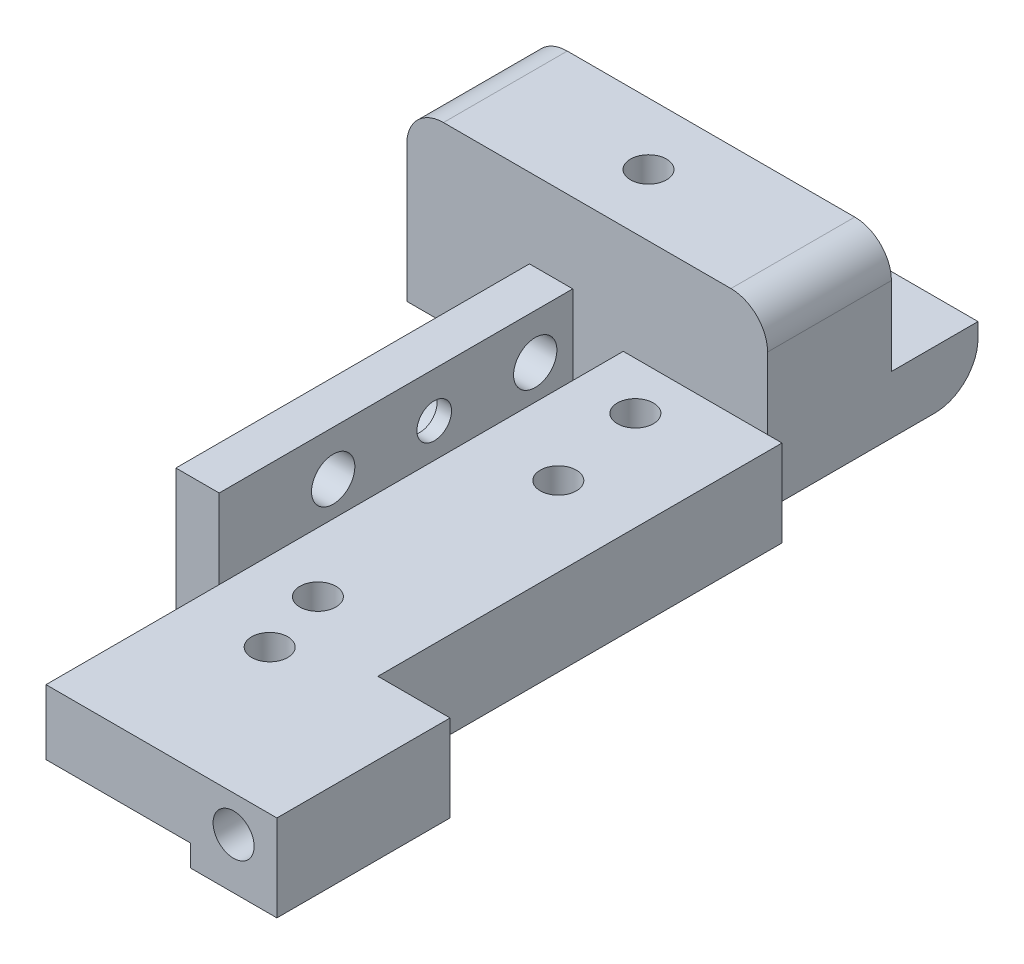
from build123d import *

# Parameters (mm, degrees)
SKETCH1_W                       = 11
SKETCH1_H                       = 40
BOSS_EXTRUDE1_DEPTH             = 4.5
SKETCH2_W                       = 1
SKETCH2_H                       = 40
BOSS_EXTRUDE2_DEPTH             = 2
M3X0_5_TAPPED_HOLE1_D           = 2.5
M3X0_5_TAPPED_HOLE1_DEPTH       = 8.5
M3X0_5_TAPPED_HOLE1_TIP         = 0.751075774
SKETCH8_W                       = 25
SKETCH8_H                       = 12
BOSS_EXTRUDE4_DEPTH             = 8.58
M3X0_5_TAPPED_HOLE2_D           = 2.5
M3X0_5_TAPPED_HOLE2_DEPTH       = 8.5
M3X0_5_TAPPED_HOLE2_TIP         = 0.751075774
SKETCH11_W                      = 24.5
SKETCH11_H                      = 10
BOSS_EXTRUDE5_DEPTH             = 3
SKETCH12_W                      = 25
SKETCH12_H                      = 4
BOSS_EXTRUDE6_DEPTH             = 6
FILLET1_R                       = 3
M3X0_5_TAPPED_HOLE4_D           = 2.5
M3X0_5_TAPPED_HOLE4_DEPTH       = 7.5
M3X0_5_TAPPED_HOLE4_TIP         = 0.751075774
SKETCH19_W                      = 5
SKETCH19_H                      = 12
BOSS_EXTRUDE7_DEPTH             = 6.5
F_4_40_TAPPED_HOLE1_D           = 2.2606
F_4_40_TAPPED_HOLE1_DEPTH       = 8.87
F_4_40_TAPPED_HOLE1_CBORE_D     = 2.8448
F_4_40_TAPPED_HOLE1_CBORE_DEPTH = 5.69
F_4_40_TAPPED_HOLE1_TIP         = 0.679152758
SKETCH23_R                      = 1.5875
CUT_EXTRUDE3_DEPTH              = 3
CBORE_FOR_M2_SHCS1_D            = 2.4
CBORE_FOR_M2_SHCS1_CBORE_D      = 4.4
CBORE_FOR_M2_SHCS1_CBORE_DEPTH  = 2
M3X0_5_TAPPED_HOLE5_D           = 3
CUT_EXTRUDE4_DEPTH              = 0.5
FILLET2_R                       = 2.54
M3X0_5_TAPPED_HOLE7_D           = 2.5
M3X0_5_TAPPED_HOLE7_DEPTH       = 9.5
M3X0_5_TAPPED_HOLE7_TIP         = 0.751075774


with BuildPart() as part:
    # Sketch1 → Boss-Extrude1 (new body)
    with BuildSketch(Plane(origin=(0, 0, 0), x_dir=(1, 0, 0), z_dir=(0, 1, 0))):
        with Locations((5.5, -20)):
            Rectangle(SKETCH1_W, SKETCH1_H)
    extrude(amount=BOSS_EXTRUDE1_DEPTH)

    # Sketch2 → Boss-Extrude2 (add)
    with BuildSketch(Plane.XZ):
        with Locations((10.5, 20)):
            Rectangle(SKETCH2_W, SKETCH2_H)
    extrude(amount=BOSS_EXTRUDE2_DEPTH)

    # M3x0.5 Tapped Hole1
    with Locations(Plane(origin=(0, 0, 0), x_dir=(-1, 0, 0), z_dir=(0, -1, 0))):
        with Locations((-5.5, -10), (-5.5, -30)):
            Hole(M3X0_5_TAPPED_HOLE1_D / 2, depth=M3X0_5_TAPPED_HOLE1_DEPTH)
            with Locations((0, 0, -(M3X0_5_TAPPED_HOLE1_DEPTH + M3X0_5_TAPPED_HOLE1_TIP / 2))):  # 118° drill point
                Cone(0, M3X0_5_TAPPED_HOLE1_D / 2, M3X0_5_TAPPED_HOLE1_TIP, mode=Mode.SUBTRACT)

    # Sketch8 → Boss-Extrude4 (add)
    with BuildSketch(Plane(origin=(0, 0, 0), x_dir=(-1, 0, 0), z_dir=(0, 0, -1))):
        with Locations((2.5, 6)):
            Rectangle(SKETCH8_W, SKETCH8_H)
    extrude(amount=BOSS_EXTRUDE4_DEPTH)

    # M3x0.5 Tapped Hole2
    with Locations(Plane(origin=(0, 4.5, 0), x_dir=(-1, 0, 0), z_dir=(0, 1, 0))):
        with Locations((-4.14, 3.3), (-4.14, 25.3)):
            Hole(M3X0_5_TAPPED_HOLE2_D / 2, depth=M3X0_5_TAPPED_HOLE2_DEPTH)
            with Locations((0, 0, -(M3X0_5_TAPPED_HOLE2_DEPTH + M3X0_5_TAPPED_HOLE2_TIP / 2))):  # 118° drill point
                Cone(0, M3X0_5_TAPPED_HOLE2_D / 2, M3X0_5_TAPPED_HOLE2_TIP, mode=Mode.SUBTRACT)

    # Sketch11 → Boss-Extrude5 (add)
    with BuildSketch(Plane(origin=(0, 0, 0), x_dir=(0, 0, -1), z_dir=(1, 0, 0))):
        with Locations((-15.75, 5)):
            Rectangle(SKETCH11_W, SKETCH11_H)
    extrude(amount=-BOSS_EXTRUDE5_DEPTH)

    # Sketch12 → Boss-Extrude6 (add)
    with BuildSketch(Plane(origin=(0, 0, -8.58), x_dir=(-1, 0, 0), z_dir=(0, 0, -1))):
        with Locations((2.5, 2)):
            Rectangle(SKETCH12_W, SKETCH12_H)
    extrude(amount=BOSS_EXTRUDE6_DEPTH)

    # Fillet1
    fillet1_edges = [part.edges().sort_by_distance(p)[0] for p in [
        (-2.5, 0, -14.58),
    ]]
    fillet(fillet1_edges, radius=FILLET1_R)

    # M3x0.5 Tapped Hole4
    with Locations(Plane(origin=(0, 0, -8.58), x_dir=(-1, 0, 0), z_dir=(0, 0, -1))):
        with Locations((-5.5, 8), (10.5, 8)):
            Hole(M3X0_5_TAPPED_HOLE4_D / 2, depth=M3X0_5_TAPPED_HOLE4_DEPTH)
            with Locations((0, 0, -(M3X0_5_TAPPED_HOLE4_DEPTH + M3X0_5_TAPPED_HOLE4_TIP / 2))):  # 118° drill point
                Cone(0, M3X0_5_TAPPED_HOLE4_D / 2, M3X0_5_TAPPED_HOLE4_TIP, mode=Mode.SUBTRACT)

    # Sketch19 → Boss-Extrude7 (add)
    with BuildSketch(Plane(origin=(0, 4.5, 0), x_dir=(1, 0, 0), z_dir=(0, 1, 0))):
        with Locations((13.5, -34)):
            Rectangle(SKETCH19_W, SKETCH19_H)
    extrude(amount=-BOSS_EXTRUDE7_DEPTH)

    # 4-40 Tapped Hole1
    with Locations(Plane.XY.offset(40)):
        with Locations((13, 2)):
            CounterBoreHole(F_4_40_TAPPED_HOLE1_D / 2, F_4_40_TAPPED_HOLE1_CBORE_D / 2, F_4_40_TAPPED_HOLE1_CBORE_DEPTH, depth=F_4_40_TAPPED_HOLE1_DEPTH)
            with Locations((0, 0, -(F_4_40_TAPPED_HOLE1_DEPTH + F_4_40_TAPPED_HOLE1_TIP / 2))):  # 118° drill point
                Cone(0, F_4_40_TAPPED_HOLE1_D / 2, F_4_40_TAPPED_HOLE1_TIP, mode=Mode.SUBTRACT)

    # Sketch23 → Cut-Extrude3 (cut)
    with BuildSketch(Plane(origin=(0, 0, 28), x_dir=(-1, 0, 0), z_dir=(0, 0, -1))):
        with Locations((-13.5, 2)):
            Circle(SKETCH23_R)
    extrude(amount=-CUT_EXTRUDE3_DEPTH, mode=Mode.SUBTRACT)

    # CBORE for M2 SHCS1 (through all)
    with Locations(Plane.ZY.offset(3)):
        with Locations((13.1, 6.88125)):
            CounterBoreHole(CBORE_FOR_M2_SHCS1_D / 2, CBORE_FOR_M2_SHCS1_CBORE_D / 2, CBORE_FOR_M2_SHCS1_CBORE_DEPTH)

    # M3x0.5 Tapped Hole5 (through all)
    with Locations(Plane.ZY.offset(3)):
        with Locations((6.1, 6.88125), (20.1, 6.88125)):
            Hole(M3X0_5_TAPPED_HOLE5_D / 2)

    # Sketch31 → Cut-Extrude4 (cut)
    with BuildSketch(Plane.XZ.offset(2)):
        Polygon((10, 40), (10, 0), (11, 0), (11, 28), (16, 28), (16, 40), align=None)
    extrude(amount=-CUT_EXTRUDE4_DEPTH, mode=Mode.SUBTRACT)

    # Fillet2
    fillet2_edges = [part.edges().sort_by_distance(p)[0] for p in [
        (-15, 12, -4.29),
        (10, 12, -4.29),
    ]]
    fillet(fillet2_edges, radius=FILLET2_R)

    # M3x0.5 Tapped Hole7
    with Locations(Plane(origin=(0, 12, 0), x_dir=(1, 0, 0), z_dir=(0, 1, 0))):
        with Locations((-2.54, 4.29)):
            Hole(M3X0_5_TAPPED_HOLE7_D / 2, depth=M3X0_5_TAPPED_HOLE7_DEPTH)
            with Locations((0, 0, -(M3X0_5_TAPPED_HOLE7_DEPTH + M3X0_5_TAPPED_HOLE7_TIP / 2))):  # 118° drill point
                Cone(0, M3X0_5_TAPPED_HOLE7_D / 2, M3X0_5_TAPPED_HOLE7_TIP, mode=Mode.SUBTRACT)


solid = part.part
